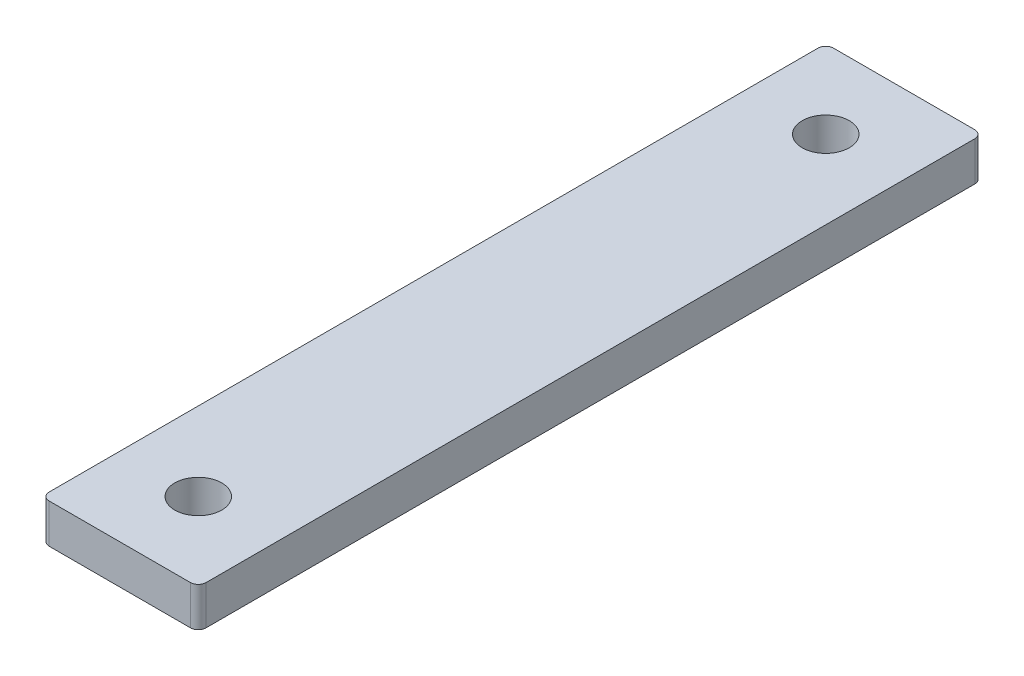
from build123d import *

# Parameters (mm, degrees)
SKETCH1_W           = 20
SKETCH1_H           = 100
SKETCH1_R           = 3
BOSS_EXTRUDE1_DEPTH = 5
FILLET1_R           = 1


with BuildPart() as part:
    # Sketch1 → Boss-Extrude1 (new body)
    with BuildSketch(Plane(origin=(0, 0, 0), x_dir=(1, 0, 0), z_dir=(0, 1, 0))):
        with Locations((10, 50)):
            Rectangle(SKETCH1_W, SKETCH1_H)
        with Locations(Location((10, 10, 0), (0, 0, 270))):
            Circle(SKETCH1_R, mode=Mode.SUBTRACT)
        with Locations(Location((10, 90, 0), (0, 0, 270))):
            Circle(SKETCH1_R, mode=Mode.SUBTRACT)
    extrude(amount=BOSS_EXTRUDE1_DEPTH)

    # Fillet1
    fillet1_edges = [part.edges().sort_by_distance(p)[0] for p in [
        (0, 2.5, -100),
        (20, 2.5, -100),
        (20, 2.5, 0),
        (0, 2.5, 0),
    ]]
    fillet(fillet1_edges, radius=FILLET1_R)


solid = part.part
